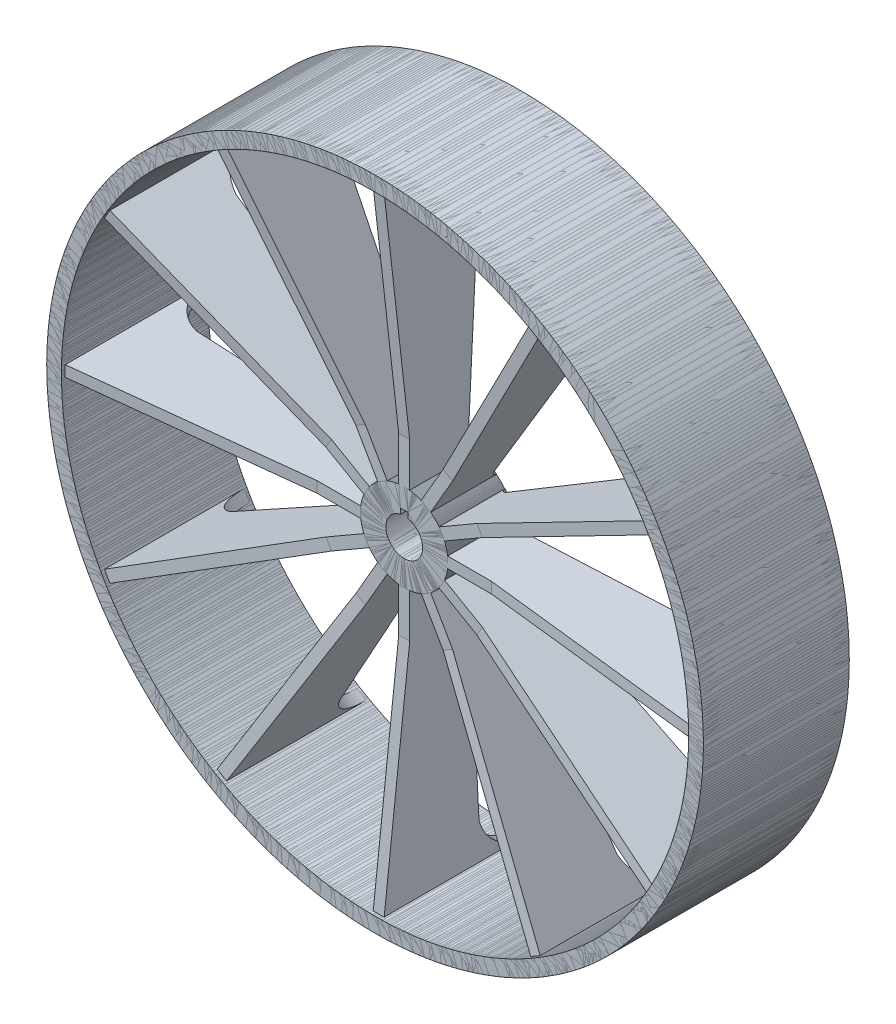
from build123d import *

# Parameters (mm, degrees)
EXTRUDE_1_DEPTH          = 25
EXTRUDE_1_DEPTH_BACK     = 15
SKETCH_1_R               = 90
SKETCH_1_R_2             = 86
EXTRUDE_1_2_DEPTH        = 25
EXTRUDE_1_2_DEPTH_BACK   = 15
SKETCH_1_R_3             = 12
SKETCH_1_R_4             = 5.05
EXTRUDE_2_DEPTH          = 24
EXTRUDE_2_DEPTH_BACK     = 15
CUT_EXTRUDE_1_REACH      = 134.32
PATTERN_CIRCULAR_1_COUNT = 12
SKETCH_5_R               = 18.31803798
CUT_EXTRUDE_4_DEPTH      = 14
CUT_EXTRUDE_2_DEPTH      = 40
SKETCH_4_R               = 12
CUT_EXTRUDE_3_DEPTH      = 8


with BuildPart() as part:
    # Sketch 1 → Extrude 1 (new, two sides: drawn at the far end of the back side and taken through both)
    with BuildSketch(Plane.XY.offset(-EXTRUDE_1_DEPTH_BACK)):
        with Locations((-11.767184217, 2.257132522)):
            Circle(SKETCH_1_R)
        with Locations((-11.767184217, 2.257132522)):
            Circle(SKETCH_1_R_2, mode=Mode.SUBTRACT)
    extrude(amount=EXTRUDE_1_DEPTH + EXTRUDE_1_DEPTH_BACK)



with BuildPart() as body_2:
    # Sketch 1 → Extrude 1 2 (new, two sides: drawn at the far end of the back side and taken through both)
    with BuildSketch(Plane.XY.offset(-EXTRUDE_1_2_DEPTH_BACK)):
        with Locations((-11.767184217, 2.257132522)):
            Circle(SKETCH_1_R_3)
        with Locations((-11.767184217, 2.257132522)):
            Circle(SKETCH_1_R_4, mode=Mode.SUBTRACT)
    extrude(amount=EXTRUDE_1_2_DEPTH + EXTRUDE_1_2_DEPTH_BACK)


with BuildPart() as part_1:
    add(part.part)

    add(body_2.part)  # Extrude 2 merges body 2
    # Sketch 1_3 → Extrude 2 (add, two sides: drawn at the far end of the back side and taken through both)
    with BuildSketch(Plane.XY.offset(-EXTRUDE_2_DEPTH_BACK)):
        with BuildLine():
            ThreePointArc((-10.267184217, 88.244050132), (-11.767184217, 88.257132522), (-13.267184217, 88.244050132))
            Line((-13.267184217, 88.244050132), (-13.267184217, 14.163013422))
            ThreePointArc((-13.267184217, 14.163013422), (-11.767184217, 14.257132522), (-10.267184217, 14.163013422))
            Line((-10.267184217, 14.163013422), (-10.267184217, 88.244050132))
        make_face()
    extrude(amount=EXTRUDE_2_DEPTH + EXTRUDE_2_DEPTH_BACK)

    # Cut-Extrude 1: up to this face of the body (flat: up to its plane)
    cut_extrude_1_end = Plane(part_1.part.faces().sort_by_distance((-13.267184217, 51.203531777, 4.5))[0])
    # Sketch 2 → Cut-Extrude 1 (cut, up to the picked face)
    with BuildSketch(Plane(origin=(-10.267184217, 0, 0), x_dir=(0, 0, -1), z_dir=(1, 0, 0)), mode=Mode.PRIVATE) as cut_extrude_1_sk1:
        with BuildLine():
            ThreePointArc((15, 88.244050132), (6.799390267, 85.454842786), (2, 78.244050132))
            Line((2, 78.244050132), (-1, 17.163013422))
            ThreePointArc((-1, 17.163013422), (-0.121320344, 15.041693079), (2, 14.163013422))
            Line((2, 14.163013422), (15, 14.163013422))
            Line((15, 14.163013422), (15, 88.244050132))
        make_face()
    cut_extrude_1_tool1 = split(extrude(cut_extrude_1_sk1.sketch, amount=-CUT_EXTRUDE_1_REACH, mode=Mode.PRIVATE), bisect_by=cut_extrude_1_end, keep=Keep.BOTH, mode=Mode.PRIVATE)
    # Sketch 2 → Cut-Extrude 1 (cut, up to the picked face)
    with BuildSketch(Plane(origin=(-10.267184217, 0, 0), x_dir=(0, 0, -1), z_dir=(1, 0, 0)), mode=Mode.PRIVATE) as cut_extrude_1_sk2:
        Polygon((-17, 26.163013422), (-24, 88.244050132), (-24, 14.163013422), (-17, 14.163013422), align=None)
    cut_extrude_1_tool2 = split(extrude(cut_extrude_1_sk2.sketch, amount=-CUT_EXTRUDE_1_REACH, mode=Mode.PRIVATE), bisect_by=cut_extrude_1_end, keep=Keep.BOTH, mode=Mode.PRIVATE)
    add(cut_extrude_1_tool1.solids().sort_by(Axis((-10.267184, 48.609272, -7.89423), (-1, 0, 0)))[0], mode=Mode.SUBTRACT)
    add(cut_extrude_1_tool2.solids().sort_by(Axis((-10.267184, 39.414306, 21.341392), (-1, 0, 0)))[0], mode=Mode.SUBTRACT)


with BuildPart() as pattern_circular_1_1:
    # Pattern Circular 1: pattern copy
    add(part_1.part.rotate(Axis((-11.767184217, 2.257132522, 0), (0, 0, 1)), 1 * 360 / PATTERN_CIRCULAR_1_COUNT))


with BuildPart() as pattern_circular_1_2:
    # Pattern Circular 1: pattern copy
    add(part_1.part.rotate(Axis((-11.767184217, 2.257132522, 0), (0, 0, 1)), 2 * 360 / PATTERN_CIRCULAR_1_COUNT))


with BuildPart() as pattern_circular_1_3:
    # Pattern Circular 1: pattern copy
    add(part_1.part.rotate(Axis((-11.767184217, 2.257132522, 0), (0, 0, 1)), 3 * 360 / PATTERN_CIRCULAR_1_COUNT))


with BuildPart() as pattern_circular_1_4:
    # Pattern Circular 1: pattern copy
    add(part_1.part.rotate(Axis((-11.767184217, 2.257132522, 0), (0, 0, 1)), 4 * 360 / PATTERN_CIRCULAR_1_COUNT))


with BuildPart() as pattern_circular_1_5:
    # Pattern Circular 1: pattern copy
    add(part_1.part.rotate(Axis((-11.767184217, 2.257132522, 0), (0, 0, 1)), 5 * 360 / PATTERN_CIRCULAR_1_COUNT))


with BuildPart() as pattern_circular_1_6:
    # Pattern Circular 1: pattern copy
    add(part_1.part.rotate(Axis((-11.767184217, 2.257132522, 0), (0, 0, 1)), 6 * 360 / PATTERN_CIRCULAR_1_COUNT))


with BuildPart() as pattern_circular_1_7:
    # Pattern Circular 1: pattern copy
    add(part_1.part.rotate(Axis((-11.767184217, 2.257132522, 0), (0, 0, 1)), 7 * 360 / PATTERN_CIRCULAR_1_COUNT))


with BuildPart() as pattern_circular_1_8:
    # Pattern Circular 1: pattern copy
    add(part_1.part.rotate(Axis((-11.767184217, 2.257132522, 0), (0, 0, 1)), 8 * 360 / PATTERN_CIRCULAR_1_COUNT))


with BuildPart() as pattern_circular_1_9:
    # Pattern Circular 1: pattern copy
    add(part_1.part.rotate(Axis((-11.767184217, 2.257132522, 0), (0, 0, 1)), 9 * 360 / PATTERN_CIRCULAR_1_COUNT))


with BuildPart() as pattern_circular_1_10:
    # Pattern Circular 1: pattern copy
    add(part_1.part.rotate(Axis((-11.767184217, 2.257132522, 0), (0, 0, 1)), 10 * 360 / PATTERN_CIRCULAR_1_COUNT))


with BuildPart() as pattern_circular_1_11:
    # Pattern Circular 1: pattern copy
    add(part_1.part.rotate(Axis((-11.767184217, 2.257132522, 0), (0, 0, 1)), 11 * 360 / PATTERN_CIRCULAR_1_COUNT))


with BuildPart() as cut_extrude_4_tool:
    # Sketch 5 → Cut-Extrude 4 (new body)
    with BuildSketch(Plane(origin=(0, 0, -15), x_dir=(-1, 0, 0), z_dir=(0, 0, -1))):
        with Locations((11.767184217, 2.257132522)):
            Circle(SKETCH_5_R)
    extrude(amount=-CUT_EXTRUDE_4_DEPTH)


with BuildPart() as part_2:
    add(part_1.part)

    # Cut-Extrude 4: cut by cut_extrude_4_tool
    add(cut_extrude_4_tool.part, mode=Mode.SUBTRACT)


with BuildPart() as pattern_circular_1_1_1:
    add(pattern_circular_1_1.part)

    # Cut-Extrude 4: cut by cut_extrude_4_tool
    add(cut_extrude_4_tool.part, mode=Mode.SUBTRACT)


with BuildPart() as pattern_circular_1_2_1:
    add(pattern_circular_1_2.part)

    # Cut-Extrude 4: cut by cut_extrude_4_tool
    add(cut_extrude_4_tool.part, mode=Mode.SUBTRACT)


with BuildPart() as pattern_circular_1_3_1:
    add(pattern_circular_1_3.part)

    # Cut-Extrude 4: cut by cut_extrude_4_tool
    add(cut_extrude_4_tool.part, mode=Mode.SUBTRACT)


with BuildPart() as pattern_circular_1_4_1:
    add(pattern_circular_1_4.part)

    # Cut-Extrude 4: cut by cut_extrude_4_tool
    add(cut_extrude_4_tool.part, mode=Mode.SUBTRACT)


with BuildPart() as pattern_circular_1_5_1:
    add(pattern_circular_1_5.part)

    # Cut-Extrude 4: cut by cut_extrude_4_tool
    add(cut_extrude_4_tool.part, mode=Mode.SUBTRACT)


with BuildPart() as pattern_circular_1_6_1:
    add(pattern_circular_1_6.part)

    # Cut-Extrude 4: cut by cut_extrude_4_tool
    add(cut_extrude_4_tool.part, mode=Mode.SUBTRACT)


with BuildPart() as pattern_circular_1_7_1:
    add(pattern_circular_1_7.part)

    # Cut-Extrude 4: cut by cut_extrude_4_tool
    add(cut_extrude_4_tool.part, mode=Mode.SUBTRACT)


with BuildPart() as pattern_circular_1_8_1:
    add(pattern_circular_1_8.part)

    # Cut-Extrude 4: cut by cut_extrude_4_tool
    add(cut_extrude_4_tool.part, mode=Mode.SUBTRACT)


with BuildPart() as pattern_circular_1_9_1:
    add(pattern_circular_1_9.part)

    # Cut-Extrude 4: cut by cut_extrude_4_tool
    add(cut_extrude_4_tool.part, mode=Mode.SUBTRACT)


with BuildPart() as pattern_circular_1_10_1:
    add(pattern_circular_1_10.part)

    # Cut-Extrude 4: cut by cut_extrude_4_tool
    add(cut_extrude_4_tool.part, mode=Mode.SUBTRACT)


with BuildPart() as pattern_circular_1_11_1:
    add(pattern_circular_1_11.part)

    # Cut-Extrude 4: cut by cut_extrude_4_tool
    add(cut_extrude_4_tool.part, mode=Mode.SUBTRACT)


with BuildPart() as cut_extrude_2_tool:
    # Sketch 3 → Cut-Extrude 2 (new body)
    with BuildSketch(Plane(origin=(0, 0, -15), x_dir=(-1, 0, 0), z_dir=(0, 0, -1))):
        with BuildLine():
            Line((12.767184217, 8.707132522), (10.767184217, 8.707132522))
            Line((10.767184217, 8.707132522), (10.767184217, 7.207132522))
            ThreePointArc((10.767184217, 7.207132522), (11.767184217, 7.307132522), (12.767184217, 7.207132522))
            Line((12.767184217, 7.207132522), (12.767184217, 8.707132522))
        make_face()
    extrude(amount=-CUT_EXTRUDE_2_DEPTH)


with BuildPart() as part_3:
    add(part_2.part)

    # Cut-Extrude 2: cut by cut_extrude_2_tool
    add(cut_extrude_2_tool.part, mode=Mode.SUBTRACT)


with BuildPart() as pattern_circular_1_1_2:
    add(pattern_circular_1_1_1.part)

    # Cut-Extrude 2: cut by cut_extrude_2_tool
    add(cut_extrude_2_tool.part, mode=Mode.SUBTRACT)


with BuildPart() as pattern_circular_1_2_2:
    add(pattern_circular_1_2_1.part)

    # Cut-Extrude 2: cut by cut_extrude_2_tool
    add(cut_extrude_2_tool.part, mode=Mode.SUBTRACT)


with BuildPart() as pattern_circular_1_3_2:
    add(pattern_circular_1_3_1.part)

    # Cut-Extrude 2: cut by cut_extrude_2_tool
    add(cut_extrude_2_tool.part, mode=Mode.SUBTRACT)


with BuildPart() as pattern_circular_1_4_2:
    add(pattern_circular_1_4_1.part)

    # Cut-Extrude 2: cut by cut_extrude_2_tool
    add(cut_extrude_2_tool.part, mode=Mode.SUBTRACT)


with BuildPart() as pattern_circular_1_5_2:
    add(pattern_circular_1_5_1.part)

    # Cut-Extrude 2: cut by cut_extrude_2_tool
    add(cut_extrude_2_tool.part, mode=Mode.SUBTRACT)


with BuildPart() as pattern_circular_1_6_2:
    add(pattern_circular_1_6_1.part)

    # Cut-Extrude 2: cut by cut_extrude_2_tool
    add(cut_extrude_2_tool.part, mode=Mode.SUBTRACT)


with BuildPart() as pattern_circular_1_7_2:
    add(pattern_circular_1_7_1.part)

    # Cut-Extrude 2: cut by cut_extrude_2_tool
    add(cut_extrude_2_tool.part, mode=Mode.SUBTRACT)


with BuildPart() as pattern_circular_1_8_2:
    add(pattern_circular_1_8_1.part)

    # Cut-Extrude 2: cut by cut_extrude_2_tool
    add(cut_extrude_2_tool.part, mode=Mode.SUBTRACT)


with BuildPart() as pattern_circular_1_9_2:
    add(pattern_circular_1_9_1.part)

    # Cut-Extrude 2: cut by cut_extrude_2_tool
    add(cut_extrude_2_tool.part, mode=Mode.SUBTRACT)


with BuildPart() as pattern_circular_1_10_2:
    add(pattern_circular_1_10_1.part)

    # Cut-Extrude 2: cut by cut_extrude_2_tool
    add(cut_extrude_2_tool.part, mode=Mode.SUBTRACT)


with BuildPart() as pattern_circular_1_11_2:
    add(pattern_circular_1_11_1.part)

    # Cut-Extrude 2: cut by cut_extrude_2_tool
    add(cut_extrude_2_tool.part, mode=Mode.SUBTRACT)


with BuildPart() as cut_extrude_3_tool:
    # Sketch 4 → Cut-Extrude 3 (new body)
    with BuildSketch(Plane.XY.offset(25)):
        with Locations((-11.767184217, 2.257132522)):
            Circle(SKETCH_4_R)
    extrude(amount=-CUT_EXTRUDE_3_DEPTH)


with BuildPart() as part_4:
    add(part_3.part)

    # Cut-Extrude 3: cut by cut_extrude_3_tool
    add(cut_extrude_3_tool.part, mode=Mode.SUBTRACT)


with BuildPart() as pattern_circular_1_1_3:
    add(pattern_circular_1_1_2.part)

    # Cut-Extrude 3: cut by cut_extrude_3_tool
    add(cut_extrude_3_tool.part, mode=Mode.SUBTRACT)


with BuildPart() as pattern_circular_1_2_3:
    add(pattern_circular_1_2_2.part)

    # Cut-Extrude 3: cut by cut_extrude_3_tool
    add(cut_extrude_3_tool.part, mode=Mode.SUBTRACT)


with BuildPart() as pattern_circular_1_3_3:
    add(pattern_circular_1_3_2.part)

    # Cut-Extrude 3: cut by cut_extrude_3_tool
    add(cut_extrude_3_tool.part, mode=Mode.SUBTRACT)


with BuildPart() as pattern_circular_1_4_3:
    add(pattern_circular_1_4_2.part)

    # Cut-Extrude 3: cut by cut_extrude_3_tool
    add(cut_extrude_3_tool.part, mode=Mode.SUBTRACT)


with BuildPart() as pattern_circular_1_5_3:
    add(pattern_circular_1_5_2.part)

    # Cut-Extrude 3: cut by cut_extrude_3_tool
    add(cut_extrude_3_tool.part, mode=Mode.SUBTRACT)


with BuildPart() as pattern_circular_1_6_3:
    add(pattern_circular_1_6_2.part)

    # Cut-Extrude 3: cut by cut_extrude_3_tool
    add(cut_extrude_3_tool.part, mode=Mode.SUBTRACT)


with BuildPart() as pattern_circular_1_7_3:
    add(pattern_circular_1_7_2.part)

    # Cut-Extrude 3: cut by cut_extrude_3_tool
    add(cut_extrude_3_tool.part, mode=Mode.SUBTRACT)


with BuildPart() as pattern_circular_1_8_3:
    add(pattern_circular_1_8_2.part)

    # Cut-Extrude 3: cut by cut_extrude_3_tool
    add(cut_extrude_3_tool.part, mode=Mode.SUBTRACT)


with BuildPart() as pattern_circular_1_9_3:
    add(pattern_circular_1_9_2.part)

    # Cut-Extrude 3: cut by cut_extrude_3_tool
    add(cut_extrude_3_tool.part, mode=Mode.SUBTRACT)


with BuildPart() as pattern_circular_1_10_3:
    add(pattern_circular_1_10_2.part)

    # Cut-Extrude 3: cut by cut_extrude_3_tool
    add(cut_extrude_3_tool.part, mode=Mode.SUBTRACT)


with BuildPart() as pattern_circular_1_11_3:
    add(pattern_circular_1_11_2.part)

    # Cut-Extrude 3: cut by cut_extrude_3_tool
    add(cut_extrude_3_tool.part, mode=Mode.SUBTRACT)


solid = Compound([part_4.part, pattern_circular_1_1_3.part, pattern_circular_1_2_3.part, pattern_circular_1_3_3.part, pattern_circular_1_4_3.part, pattern_circular_1_5_3.part, pattern_circular_1_6_3.part, pattern_circular_1_7_3.part, pattern_circular_1_8_3.part, pattern_circular_1_9_3.part, pattern_circular_1_10_3.part, pattern_circular_1_11_3.part])
